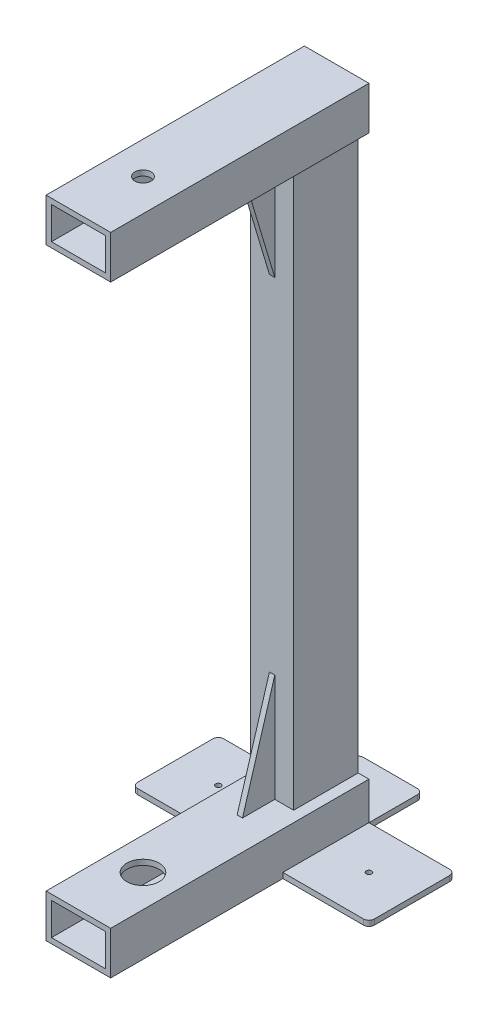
from build123d import *

# Parameters (mm, degrees)
SKETCH1_W                  = 50.8
SKETCH1_H                  = 660.4
BOSS_EXTRUDE1_DEPTH        = 76.2
SKETCH8_W                  = 38.1
SKETCH8_H                  = 63.5
CUT_EXTRUDE3_DEPTH         = 666.266683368
SKETCH2_W                  = 76.2
SKETCH2_H                  = 50.8
BOSS_EXTRUDE2_DEPTH        = 304.8
BOSS_EXTRUDE2_2_DEPTH      = 304.8
SKETCH9_W                  = 63.5
SKETCH9_H                  = 38.1
CUT_EXTRUDE4_DEPTH         = 490.403361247
BOSS_EXTRUDE3_DEPTH        = 3.175
BOSS_EXTRUDE3_DEPTH_BACK   = 3.175
BOSS_EXTRUDE3_2_DEPTH      = 3.175
BOSS_EXTRUDE3_2_DEPTH_BACK = 3.175
SKETCH4_W                  = 101.6
SKETCH4_H                  = 101.6
BOSS_EXTRUDE4_DEPTH        = 6.35
SKETCH7_W                  = 63.5
SKETCH7_H                  = 38.1
CUT_EXTRUDE2_DEPTH         = 508.523526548
SKETCH6_R                  = 19.05
CUT_EXTRUDE1_DEPTH         = 6.35
SKETCH10_W                 = 76.2
SKETCH10_H                 = 63.5
BOSS_EXTRUDE5_DEPTH        = 6.35
CUT_EXTRUDE5_REACH         = 834.504
SKETCH11_R                 = 9.525
CUT_EXTRUDE6_DEPTH         = 827.695864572
CUT_EXTRUDE6_DEPTH_BACK    = 827.695864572
SKETCH12_R                 = 3.175
FILLET1_R                  = 6.35


with BuildPart() as part:
    # Sketch1 → Boss-Extrude1 (new body)
    with BuildSketch(Plane.XY):
        Rectangle(SKETCH1_W, SKETCH1_H)
    extrude(amount=BOSS_EXTRUDE1_DEPTH)

    # Sketch8 → Cut-Extrude3 (cut, through all)
    with BuildSketch(Plane(origin=(0, 330.2, 0), x_dir=(1, 0, 0), z_dir=(0, 1, 0))):
        with Locations((0, -38.1)):
            Rectangle(SKETCH8_W, SKETCH8_H)
    extrude(amount=-CUT_EXTRUDE3_DEPTH, mode=Mode.SUBTRACT)


with BuildPart() as body_2:
    # Sketch2 → Boss-Extrude2 (new body)
    with BuildSketch(Plane(origin=(0, 0, 0), x_dir=(-1, 0, 0), z_dir=(0, 0, -1))):
        with Locations((0, 355.6)):
            Rectangle(SKETCH2_W, SKETCH2_H)
    extrude(amount=-BOSS_EXTRUDE2_DEPTH)

    # Sketch9 → Cut-Extrude4 (cut, through all)
    with BuildSketch(Plane.XY.offset(304.8)):
        with Locations((0, 355.6)):
            Rectangle(SKETCH9_W, SKETCH9_H)
    extrude(amount=-CUT_EXTRUDE4_DEPTH, mode=Mode.SUBTRACT)

    # Cut-Extrude5: up to this face of the body (flat: up to its plane)
    cut_extrude5_end = Plane(body_2.part.faces().sort_by_distance((0, 330.2, 152.4))[0])
    # Sketch11 → Cut-Extrude5 (cut, up to the picked face)
    with BuildSketch(Plane(origin=(0, 381, 0), x_dir=(1, 0, 0), z_dir=(0, 1, 0)), mode=Mode.PRIVATE) as cut_extrude5_sk1:
        with Locations(Location((0, -228.6, 0), (0, 0, 270))):
            Circle(SKETCH11_R)
    cut_extrude5_tool1 = split(extrude(cut_extrude5_sk1.sketch, amount=-CUT_EXTRUDE5_REACH, mode=Mode.PRIVATE), bisect_by=cut_extrude5_end, keep=Keep.BOTH, mode=Mode.PRIVATE)
    add(cut_extrude5_tool1.solids().sort_by(Axis((0, 381, 228.6), (0, -1, 0)))[0], mode=Mode.SUBTRACT)


with BuildPart() as body_3:
    # Sketch2 → Boss-Extrude2 2 (new body)
    with BuildSketch(Plane(origin=(0, 0, 0), x_dir=(-1, 0, 0), z_dir=(0, 0, -1))):
        with Locations((0, -355.6)):
            Rectangle(SKETCH2_W, SKETCH2_H)
    extrude(amount=-BOSS_EXTRUDE2_2_DEPTH)

    # Sketch4 → Boss-Extrude4 (add)
    with BuildSketch(Plane.XZ.offset(381)):
        with Locations((-88.9, 50.8)):
            Rectangle(SKETCH4_W, SKETCH4_H)
        with Locations((88.9, 50.8)):
            Rectangle(SKETCH4_W, SKETCH4_H)
    extrude(amount=-BOSS_EXTRUDE4_DEPTH)

    # Sketch7 → Cut-Extrude2 (cut, through all)
    with BuildSketch(Plane.XY.offset(304.8)):
        with Locations((0, -355.6)):
            Rectangle(SKETCH7_W, SKETCH7_H)
    extrude(amount=-CUT_EXTRUDE2_DEPTH, mode=Mode.SUBTRACT)

    # Sketch6 → Cut-Extrude1 (cut)
    with BuildSketch(Plane(origin=(0, -330.2, 0), x_dir=(1, 0, 0), z_dir=(0, 1, 0))):
        with Locations(Location((0, -228.6, 0), (0, 0, 270))):
            Circle(SKETCH6_R)
    extrude(amount=-CUT_EXTRUDE1_DEPTH, mode=Mode.SUBTRACT)

    # Sketch10 → Boss-Extrude5 (add)
    with BuildSketch(Plane.XZ.offset(381)):
        with Locations((0, -31.75)):
            Rectangle(SKETCH10_W, SKETCH10_H)
    extrude(amount=-BOSS_EXTRUDE5_DEPTH)

    # Sketch12 → Cut-Extrude6 (cut, two sides: drawn at the far end of the back side and taken through both)
    with BuildSketch(Plane(origin=(0, -374.65, 0), x_dir=(1, 0, 0), z_dir=(0, 1, 0)).offset(-CUT_EXTRUDE6_DEPTH_BACK)):
        with Locations(Location((-88.9, -50.8, 0), (0, 0, 270))):
            Circle(SKETCH12_R)
        with Locations(Location((0, 31.75, 0), (0, 0, 270))):
            Circle(SKETCH12_R)
        with Locations(Location((88.9, -50.8, 0), (0, 0, 270))):
            Circle(SKETCH12_R)
    extrude(amount=CUT_EXTRUDE6_DEPTH + CUT_EXTRUDE6_DEPTH_BACK, mode=Mode.SUBTRACT)

    # Fillet1
    fillet1_edges = [body_3.edges().sort_by_distance(p)[0] for p in [
        (-139.7, -377.825, 0),
        (-139.7, -377.825, 101.6),
        (139.7, -377.825, 101.6),
        (139.7, -377.825, 0),
        (-38.1, -377.825, -63.5),
        (38.1, -377.825, -63.5),
    ]]
    fillet(fillet1_edges, radius=FILLET1_R)


with BuildPart() as body_4:
    # Sketch3 → Boss-Extrude3 (new, two sides: drawn at the far end of the back side and taken through both)
    with BuildSketch(Plane(origin=(0, 0, 0), x_dir=(0, 0, -1), z_dir=(1, 0, 0)).offset(-BOSS_EXTRUDE3_DEPTH_BACK)):
        Polygon((-114.3, 330.2), (-76.2, 330.2), (-76.2, 203.2), align=None)
    extrude(amount=BOSS_EXTRUDE3_DEPTH + BOSS_EXTRUDE3_DEPTH_BACK)


with BuildPart() as body_5:
    # Sketch3 → Boss-Extrude3 2 (new, two sides: drawn at the far end of the back side and taken through both)
    with BuildSketch(Plane(origin=(0, 0, 0), x_dir=(0, 0, -1), z_dir=(1, 0, 0)).offset(-BOSS_EXTRUDE3_2_DEPTH_BACK)):
        Polygon((-114.3, -330.2), (-76.2, -330.2), (-76.2, -203.2), align=None)
    extrude(amount=BOSS_EXTRUDE3_2_DEPTH + BOSS_EXTRUDE3_2_DEPTH_BACK)


solid = Compound([part.part, body_2.part, body_3.part, body_4.part, body_5.part])
